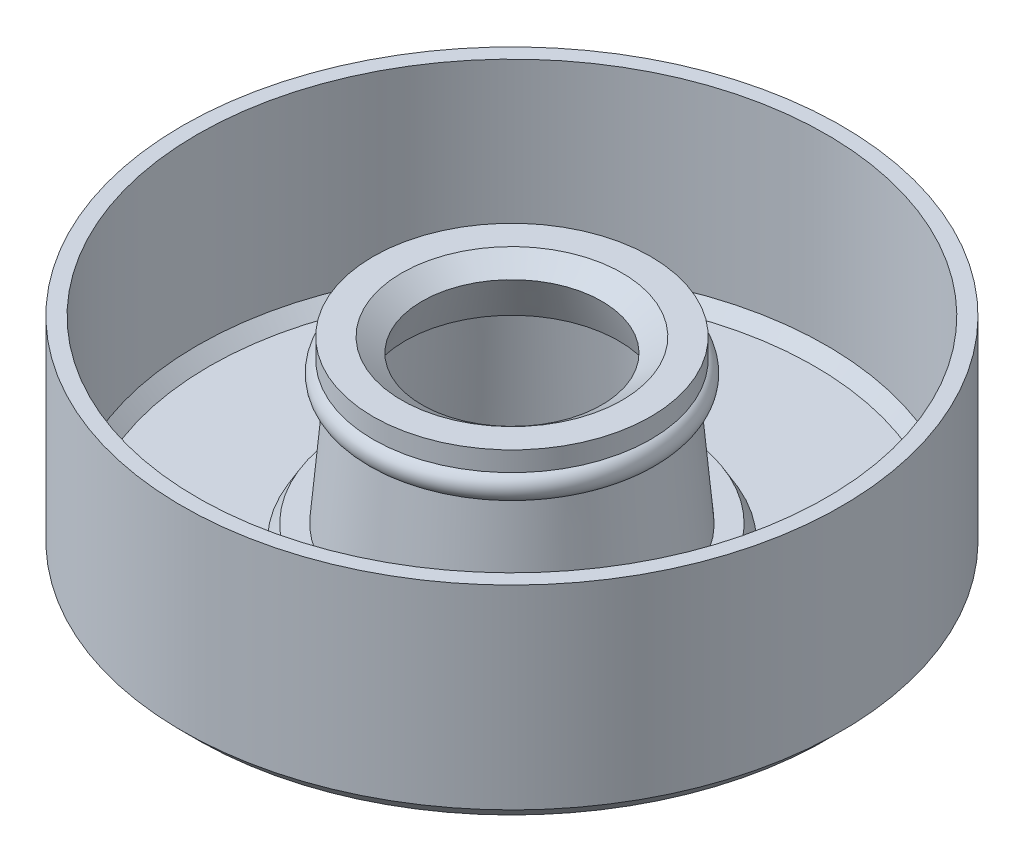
from build123d import *


with BuildPart() as part:
    # Sketch 1 → Revolve 1 (revolve)
    with BuildSketch(Plane.XY):
        with BuildLine():
            Line((-10.5, 0), (-5.769439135, 0))
            ThreePointArc((-5.769439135, 0), (-5.259121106, 0.133562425), (-4.879665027, 0.5))
            Line((-4.879665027, 0.5), (-4.315491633, 0))
            Line((-4.315491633, 0), (-3.565536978, 0.06561253))
            Line((-3.565536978, 0.06561253), (-4.315491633, 0.5))
            Line((-4.315491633, 0.5), (-3.965536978, 4.5))
            Line((-3.965536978, 4.5), (-3.565536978, 4.5))
            Line((-3.565536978, 4.5), (-3, 5.928571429))
            Line((-3, 5.928571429), (-3.680070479, 6.404761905))
            Line((-3.680070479, 6.404761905), (-4.632451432, 6.404761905))
            Line((-4.632451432, 6.404761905), (-4.632451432, 5.747213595))
            ThreePointArc((-4.632451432, 5.747213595), (-4.867701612, 5.244464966), (-4.432451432, 4.9))
            Line((-4.432451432, 4.9), (-4.77365722, 1))
            Line((-4.77365722, 1), (-5.480764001, 1))
            Line((-5.480764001, 1), (-5.769439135, 0.5))
            Line((-5.769439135, 0.5), (-10.1, 0.5))
            Line((-10.1, 0.5), (-10.5, 0.9))
            Line((-10.5, 0.9), (-10.5, 7))
            Line((-10.5, 7), (-11, 7))
            Line((-11, 7), (-11, 0.5))
            Line((-11, 0.5), (-10.5, 0))
        make_face()
    revolve(axis=Axis((0, 5.977335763, 0), (0, -1, 0)))


solid = part.part
